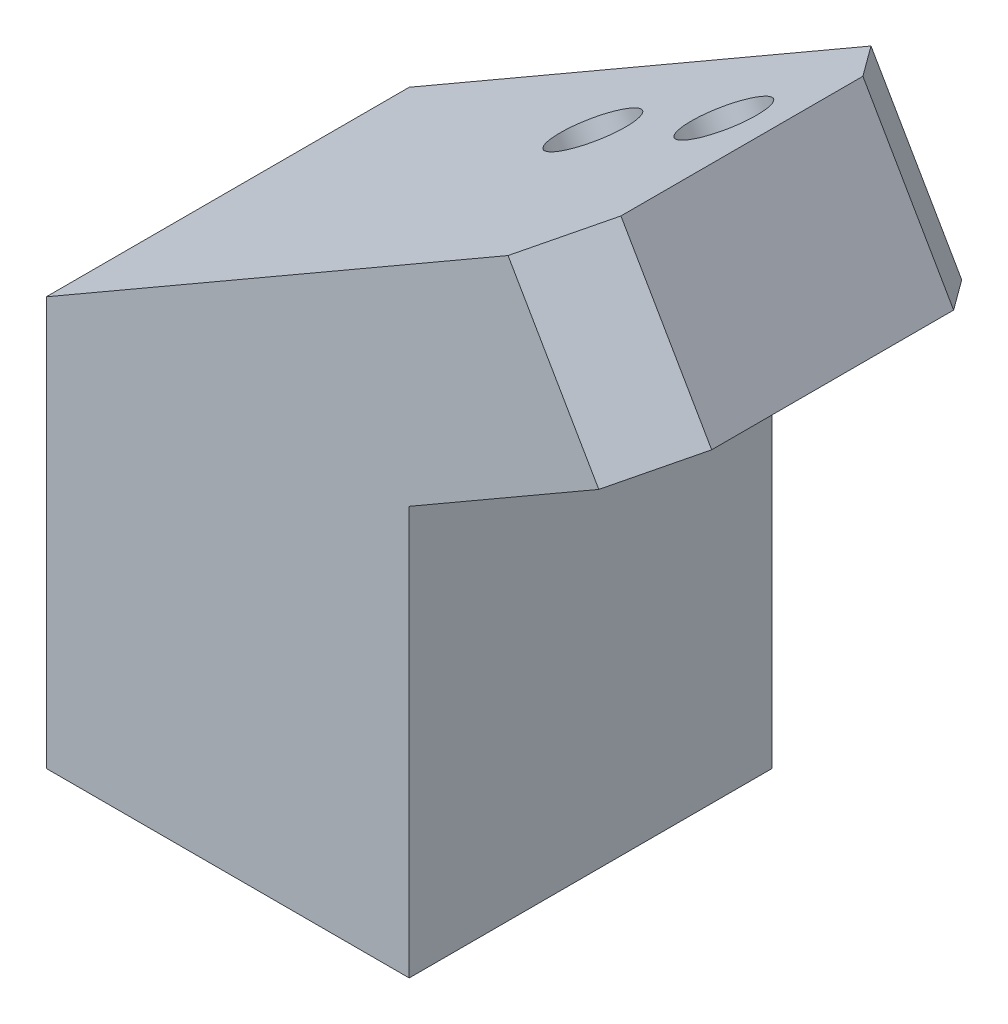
ISO-10303-21;
HEADER;
FILE_DESCRIPTION(('STEP AP214'),'2;1');
FILE_NAME('part.step','',(''),(''),'','','');
FILE_SCHEMA(('AUTOMOTIVE_DESIGN { 1 0 10303 214 1 1 1 1 }'));
ENDSEC;
DATA;
#1=APPLICATION_CONTEXT('core data for automotive mechanical design processes');
#2=APPLICATION_PROTOCOL_DEFINITION('international standard','automotive_design',2000,#1);
#3=PRODUCT_CONTEXT('',#1,'mechanical');
#4=PRODUCT('Part','Part','',(#3));
#5=PRODUCT_RELATED_PRODUCT_CATEGORY('part','',(#4));
#6=PRODUCT_DEFINITION_FORMATION('','',#4);
#7=PRODUCT_DEFINITION_CONTEXT('part definition',#1,'design');
#8=PRODUCT_DEFINITION('design','',#6,#7);
#9=PRODUCT_DEFINITION_SHAPE('','',#8);
#10=(LENGTH_UNIT() NAMED_UNIT(*) SI_UNIT(.MILLI.,.METRE.));
#11=(NAMED_UNIT(*) PLANE_ANGLE_UNIT() SI_UNIT($,.RADIAN.));
#12=(NAMED_UNIT(*) SI_UNIT($,.STERADIAN.) SOLID_ANGLE_UNIT());
#13=UNCERTAINTY_MEASURE_WITH_UNIT(LENGTH_MEASURE(1.E-05),#10,'distance_accuracy_value','');
#14=(GEOMETRIC_REPRESENTATION_CONTEXT(3) GLOBAL_UNCERTAINTY_ASSIGNED_CONTEXT((#13)) GLOBAL_UNIT_ASSIGNED_CONTEXT((#10,
#11,#12)) REPRESENTATION_CONTEXT('',''));
#15=CARTESIAN_POINT('',(0.,0.,0.));
#16=DIRECTION('',(0.,0.,1.));
#17=DIRECTION('',(1.,0.,0.));
#18=AXIS2_PLACEMENT_3D('',#15,#16,#17);
#19=CARTESIAN_POINT('',(45.9711431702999,-64.2630029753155,12.));
#20=DIRECTION('',(0.,1.,0.));
#21=DIRECTION('',(0.,0.,1.));
#22=AXIS2_PLACEMENT_3D('',#19,#20,#21);
#23=PLANE('',#22);
#24=CARTESIAN_POINT('',(59.9711431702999,-64.2630029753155,3.25));
#25=DIRECTION('',(0.,-1.,0.));
#26=DIRECTION('',(0.,0.,-1.));
#27=AXIS2_PLACEMENT_3D('',#24,#25,#26);
#28=CIRCLE('',#27,1.24999999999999);
#29=CARTESIAN_POINT('',(59.9711431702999,-64.2630029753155,2.00000000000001));
#30=VERTEX_POINT('',#29);
#31=EDGE_CURVE('E103',#30,#30,#28,.T.);
#32=ORIENTED_EDGE('',*,*,#31,.F.);
#33=EDGE_LOOP('',(#32));
#34=FACE_BOUND('',#33,.T.);
#35=CARTESIAN_POINT('',(55.9711431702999,-64.2630029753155,8.75));
#36=DIRECTION('',(0.,-1.,0.));
#37=DIRECTION('',(0.,0.,-1.));
#38=AXIS2_PLACEMENT_3D('',#35,#36,#37);
#39=CIRCLE('',#38,1.24999999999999);
#40=CARTESIAN_POINT('',(55.9711431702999,-64.2630029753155,7.50000000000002));
#41=VERTEX_POINT('',#40);
#42=EDGE_CURVE('E102',#41,#41,#39,.T.);
#43=ORIENTED_EDGE('',*,*,#42,.F.);
#44=EDGE_LOOP('',(#43));
#45=FACE_BOUND('',#44,.T.);
#46=DIRECTION('',(1.,0.,0.));
#47=VECTOR('',#46,1.);
#48=CARTESIAN_POINT('',(45.9711431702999,-64.2630029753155,12.));
#49=LINE('',#48,#47);
#50=CARTESIAN_POINT('',(51.9711431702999,-64.2630029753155,12.));
#51=VERTEX_POINT('',#50);
#52=CARTESIAN_POINT('',(63.9711431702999,-64.2630029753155,12.));
#53=VERTEX_POINT('',#52);
#54=EDGE_CURVE('E129',#51,#53,#49,.T.);
#55=ORIENTED_EDGE('',*,*,#54,.F.);
#56=DIRECTION('',(0.,0.,1.));
#57=VECTOR('',#56,1.);
#58=CARTESIAN_POINT('',(51.9711431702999,-64.2630029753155,0.));
#59=LINE('',#58,#57);
#60=CARTESIAN_POINT('',(51.9711431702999,-64.2630029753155,0.));
#61=VERTEX_POINT('',#60);
#62=EDGE_CURVE('E113',#61,#51,#59,.T.);
#63=ORIENTED_EDGE('',*,*,#62,.F.);
#64=DIRECTION('',(1.,0.,0.));
#65=VECTOR('',#64,1.);
#66=CARTESIAN_POINT('',(45.9711431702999,-64.2630029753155,0.));
#67=LINE('',#66,#65);
#68=CARTESIAN_POINT('',(63.9711431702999,-64.2630029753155,0.));
#69=VERTEX_POINT('',#68);
#70=EDGE_CURVE('E140',#61,#69,#67,.T.);
#71=ORIENTED_EDGE('',*,*,#70,.T.);
#72=DIRECTION('',(0.,0.,-1.));
#73=VECTOR('',#72,1.);
#74=CARTESIAN_POINT('',(63.9711431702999,-64.2630029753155,12.));
#75=LINE('',#74,#73);
#76=EDGE_CURVE('E159',#53,#69,#75,.T.);
#77=ORIENTED_EDGE('',*,*,#76,.F.);
#78=EDGE_LOOP('',(#55,#63,#71,#77));
#79=FACE_BOUND('',#78,.T.);
#80=ADVANCED_FACE('F16',(#34,#45,#79),#23,.F.);
#81=CARTESIAN_POINT('',(63.9711431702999,-64.2630029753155,12.));
#82=DIRECTION('',(-1.,0.,0.));
#83=DIRECTION('',(0.,0.,1.));
#84=AXIS2_PLACEMENT_3D('',#81,#82,#83);
#85=PLANE('',#84);
#86=DIRECTION('',(0.,1.,0.));
#87=VECTOR('',#86,1.);
#88=CARTESIAN_POINT('',(63.9711431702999,-64.2630029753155,0.));
#89=LINE('',#88,#87);
#90=CARTESIAN_POINT('',(63.9711431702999,-50.7574494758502,0.));
#91=VERTEX_POINT('',#90);
#92=EDGE_CURVE('E142',#69,#91,#89,.T.);
#93=ORIENTED_EDGE('',*,*,#92,.T.);
#94=DIRECTION('',(0.,0.,-1.));
#95=VECTOR('',#94,1.);
#96=CARTESIAN_POINT('',(63.9711431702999,-50.7574494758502,12.));
#97=LINE('',#96,#95);
#98=CARTESIAN_POINT('',(63.9711431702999,-50.7574494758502,3.82439937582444));
#99=VERTEX_POINT('',#98);
#100=EDGE_CURVE('E155',#99,#91,#97,.T.);
#101=ORIENTED_EDGE('',*,*,#100,.F.);
#102=CARTESIAN_POINT('',(63.9711431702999,-50.7574494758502,4.17560062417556));
#103=VERTEX_POINT('',#102);
#104=EDGE_CURVE('E160',#103,#99,#97,.T.);
#105=ORIENTED_EDGE('',*,*,#104,.F.);
#106=CARTESIAN_POINT('',(63.9711431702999,-50.7574494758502,12.));
#107=VERTEX_POINT('',#106);
#108=EDGE_CURVE('E156',#107,#103,#97,.T.);
#109=ORIENTED_EDGE('',*,*,#108,.F.);
#110=DIRECTION('',(0.,1.,0.));
#111=VECTOR('',#110,1.);
#112=CARTESIAN_POINT('',(63.9711431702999,-64.2630029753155,12.));
#113=LINE('',#112,#111);
#114=EDGE_CURVE('E131',#53,#107,#113,.T.);
#115=ORIENTED_EDGE('',*,*,#114,.F.);
#116=ORIENTED_EDGE('',*,*,#76,.T.);
#117=EDGE_LOOP('',(#93,#101,#105,#109,#115,#116));
#118=FACE_BOUND('',#117,.T.);
#119=ADVANCED_FACE('F213',(#118),#85,.F.);
#120=CARTESIAN_POINT('',(71.9711431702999,-46.1386473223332,12.));
#121=DIRECTION('',(-0.5,0.86602540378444,0.));
#122=DIRECTION('',(-0.86602540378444,-0.5,0.));
#123=AXIS2_PLACEMENT_3D('',#120,#121,#122);
#124=PLANE('',#123);
#125=CARTESIAN_POINT('',(69.3730669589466,-47.6386473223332,4.));
#126=DIRECTION('',(0.5,-0.86602540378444,0.));
#127=DIRECTION('',(0.86602540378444,0.5,0.));
#128=AXIS2_PLACEMENT_3D('',#125,#126,#127);
#129=CIRCLE('',#128,1.24999999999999);
#130=CARTESIAN_POINT('',(70.4555987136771,-47.0136473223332,4.));
#131=VERTEX_POINT('',#130);
#132=EDGE_CURVE('E119',#131,#131,#129,.T.);
#133=ORIENTED_EDGE('',*,*,#132,.F.);
#134=EDGE_LOOP('',(#133));
#135=FACE_BOUND('',#134,.T.);
#136=DIRECTION('',(0.86602540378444,0.5,0.));
#137=VECTOR('',#136,1.);
#138=CARTESIAN_POINT('',(71.9711431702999,-46.1386473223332,0.));
#139=LINE('',#138,#137);
#140=CARTESIAN_POINT('',(70.239092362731,-47.1386473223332,0.));
#141=VERTEX_POINT('',#140);
#142=EDGE_CURVE('E145',#91,#141,#139,.T.);
#143=ORIENTED_EDGE('',*,*,#142,.T.);
#144=DIRECTION('',(-0.612372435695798,-0.353553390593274,-0.707106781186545));
#145=VECTOR('',#144,1.);
#146=CARTESIAN_POINT('',(71.9711431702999,-46.1386473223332,2.));
#147=LINE('',#146,#145);
#148=CARTESIAN_POINT('',(71.9711431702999,-46.1386473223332,2.));
#149=VERTEX_POINT('',#148);
#150=EDGE_CURVE('E177',#141,#149,#147,.F.);
#151=ORIENTED_EDGE('',*,*,#150,.T.);
#152=DIRECTION('',(0.,0.,-1.));
#153=VECTOR('',#152,1.);
#154=CARTESIAN_POINT('',(71.9711431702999,-46.1386473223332,12.));
#155=LINE('',#154,#153);
#156=CARTESIAN_POINT('',(71.9711431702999,-46.1386473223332,10.));
#157=VERTEX_POINT('',#156);
#158=EDGE_CURVE('E152',#157,#149,#155,.T.);
#159=ORIENTED_EDGE('',*,*,#158,.F.);
#160=DIRECTION('',(-0.612372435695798,-0.353553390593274,0.707106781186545));
#161=VECTOR('',#160,1.);
#162=CARTESIAN_POINT('',(70.239092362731,-47.1386473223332,12.));
#163=LINE('',#162,#161);
#164=CARTESIAN_POINT('',(70.239092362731,-47.1386473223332,12.));
#165=VERTEX_POINT('',#164);
#166=EDGE_CURVE('E38',#157,#165,#163,.T.);
#167=ORIENTED_EDGE('',*,*,#166,.T.);
#168=DIRECTION('',(0.86602540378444,0.5,0.));
#169=VECTOR('',#168,1.);
#170=CARTESIAN_POINT('',(71.9711431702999,-46.1386473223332,12.));
#171=LINE('',#170,#169);
#172=EDGE_CURVE('E134',#107,#165,#171,.T.);
#173=ORIENTED_EDGE('',*,*,#172,.F.);
#174=ORIENTED_EDGE('',*,*,#108,.T.);
#175=CARTESIAN_POINT('',(65.0429399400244,-50.1386473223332,4.));
#176=DIRECTION('',(0.5,-0.86602540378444,0.));
#177=DIRECTION('',(0.86602540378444,0.5,0.));
#178=AXIS2_PLACEMENT_3D('',#175,#176,#177);
#179=CIRCLE('',#178,1.24999999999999);
#180=EDGE_CURVE('E125',#99,#103,#179,.T.);
#181=ORIENTED_EDGE('',*,*,#180,.F.);
#182=ORIENTED_EDGE('',*,*,#100,.T.);
#183=EDGE_LOOP('',(#143,#151,#159,#167,#173,#174,#181,#182));
#184=FACE_BOUND('',#183,.T.);
#185=ADVANCED_FACE('F197',(#135,#184),#124,.F.);
#186=CARTESIAN_POINT('',(68.9711431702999,-40.9424948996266,12.));
#187=DIRECTION('',(-0.86602540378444,-0.5,0.));
#188=DIRECTION('',(0.5,-0.86602540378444,0.));
#189=AXIS2_PLACEMENT_3D('',#186,#187,#188);
#190=PLANE('',#189);
#191=ORIENTED_EDGE('',*,*,#158,.T.);
#192=DIRECTION('',(-0.5,0.86602540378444,0.));
#193=VECTOR('',#192,1.);
#194=CARTESIAN_POINT('',(68.9711431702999,-40.9424948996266,2.));
#195=LINE('',#194,#193);
#196=CARTESIAN_POINT('',(68.9711431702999,-40.9424948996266,2.));
#197=VERTEX_POINT('',#196);
#198=EDGE_CURVE('E167',#149,#197,#195,.T.);
#199=ORIENTED_EDGE('',*,*,#198,.T.);
#200=DIRECTION('',(0.,0.,-1.));
#201=VECTOR('',#200,1.);
#202=CARTESIAN_POINT('',(68.9711431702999,-40.9424948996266,12.));
#203=LINE('',#202,#201);
#204=CARTESIAN_POINT('',(68.9711431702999,-40.9424948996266,10.));
#205=VERTEX_POINT('',#204);
#206=EDGE_CURVE('E139',#205,#197,#203,.T.);
#207=ORIENTED_EDGE('',*,*,#206,.F.);
#208=DIRECTION('',(0.5,-0.86602540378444,0.));
#209=VECTOR('',#208,1.);
#210=CARTESIAN_POINT('',(71.9711431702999,-46.1386473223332,10.));
#211=LINE('',#210,#209);
#212=EDGE_CURVE('E163',#205,#157,#211,.T.);
#213=ORIENTED_EDGE('',*,*,#212,.T.);
#214=EDGE_LOOP('',(#191,#199,#207,#213));
#215=FACE_BOUND('',#214,.T.);
#216=ADVANCED_FACE('F199',(#215),#190,.F.);
#217=CARTESIAN_POINT('',(68.9711431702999,-40.9424948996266,12.));
#218=DIRECTION('',(0.5,-0.866025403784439,0.));
#219=DIRECTION('',(0.866025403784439,0.5,0.));
#220=AXIS2_PLACEMENT_3D('',#217,#218,#219);
#221=PLANE('',#220);
#222=CARTESIAN_POINT('',(66.3730669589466,-42.4424948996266,4.));
#223=DIRECTION('',(0.5,-0.866025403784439,0.));
#224=DIRECTION('',(0.866025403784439,0.5,0.));
#225=AXIS2_PLACEMENT_3D('',#222,#223,#224);
#226=CIRCLE('',#225,1.25);
#227=CARTESIAN_POINT('',(67.4555987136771,-41.8174948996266,4.));
#228=VERTEX_POINT('',#227);
#229=EDGE_CURVE('E122',#228,#228,#226,.T.);
#230=ORIENTED_EDGE('',*,*,#229,.T.);
#231=EDGE_LOOP('',(#230));
#232=FACE_BOUND('',#231,.T.);
#233=CARTESIAN_POINT('',(62.0429399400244,-44.9424948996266,4.));
#234=DIRECTION('',(0.5,-0.866025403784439,0.));
#235=DIRECTION('',(0.866025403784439,0.5,0.));
#236=AXIS2_PLACEMENT_3D('',#233,#234,#235);
#237=CIRCLE('',#236,1.25);
#238=CARTESIAN_POINT('',(63.1254716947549,-44.3174948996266,4.));
#239=VERTEX_POINT('',#238);
#240=EDGE_CURVE('E128',#239,#239,#237,.T.);
#241=ORIENTED_EDGE('',*,*,#240,.T.);
#242=EDGE_LOOP('',(#241));
#243=FACE_BOUND('',#242,.T.);
#244=DIRECTION('',(-0.866025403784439,-0.5,0.));
#245=VECTOR('',#244,1.);
#246=CARTESIAN_POINT('',(68.9711431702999,-40.9424948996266,0.));
#247=LINE('',#246,#245);
#248=CARTESIAN_POINT('',(67.239092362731,-41.9424948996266,0.));
#249=VERTEX_POINT('',#248);
#250=CARTESIAN_POINT('',(51.9711431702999,-50.7574494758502,0.));
#251=VERTEX_POINT('',#250);
#252=EDGE_CURVE('E132',#249,#251,#247,.T.);
#253=ORIENTED_EDGE('',*,*,#252,.T.);
#254=DIRECTION('',(0.,0.,1.));
#255=VECTOR('',#254,1.);
#256=CARTESIAN_POINT('',(51.9711431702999,-50.7574494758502,12.));
#257=LINE('',#256,#255);
#258=CARTESIAN_POINT('',(51.9711431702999,-50.7574494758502,12.));
#259=VERTEX_POINT('',#258);
#260=EDGE_CURVE('E31',#251,#259,#257,.T.);
#261=ORIENTED_EDGE('',*,*,#260,.T.);
#262=DIRECTION('',(-0.866025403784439,-0.5,0.));
#263=VECTOR('',#262,1.);
#264=CARTESIAN_POINT('',(68.9711431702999,-40.9424948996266,12.));
#265=LINE('',#264,#263);
#266=CARTESIAN_POINT('',(67.239092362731,-41.9424948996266,12.));
#267=VERTEX_POINT('',#266);
#268=EDGE_CURVE('E136',#267,#259,#265,.T.);
#269=ORIENTED_EDGE('',*,*,#268,.F.);
#270=DIRECTION('',(0.612372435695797,0.353553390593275,-0.707106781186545));
#271=VECTOR('',#270,1.);
#272=CARTESIAN_POINT('',(67.2390923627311,-41.9424948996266,12.));
#273=LINE('',#272,#271);
#274=EDGE_CURVE('E170',#267,#205,#273,.T.);
#275=ORIENTED_EDGE('',*,*,#274,.T.);
#276=ORIENTED_EDGE('',*,*,#206,.T.);
#277=DIRECTION('',(0.612372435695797,0.353553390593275,0.707106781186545));
#278=VECTOR('',#277,1.);
#279=CARTESIAN_POINT('',(68.9711431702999,-40.9424948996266,2.));
#280=LINE('',#279,#278);
#281=EDGE_CURVE('E172',#197,#249,#280,.F.);
#282=ORIENTED_EDGE('',*,*,#281,.T.);
#283=EDGE_LOOP('',(#253,#261,#269,#275,#276,#282));
#284=FACE_BOUND('',#283,.T.);
#285=ADVANCED_FACE('F185',(#232,#243,#284),#221,.F.);
#286=CARTESIAN_POINT('',(0.,0.,12.));
#287=DIRECTION('',(0.,0.,1.));
#288=DIRECTION('',(1.,0.,0.));
#289=AXIS2_PLACEMENT_3D('',#286,#287,#288);
#290=PLANE('',#289);
#291=DIRECTION('',(0.,-1.,0.));
#292=VECTOR('',#291,1.);
#293=CARTESIAN_POINT('',(51.9711431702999,-40.9424948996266,12.));
#294=LINE('',#293,#292);
#295=EDGE_CURVE('E115',#259,#51,#294,.T.);
#296=ORIENTED_EDGE('',*,*,#295,.T.);
#297=ORIENTED_EDGE('',*,*,#54,.T.);
#298=ORIENTED_EDGE('',*,*,#114,.T.);
#299=ORIENTED_EDGE('',*,*,#172,.T.);
#300=DIRECTION('',(-0.5,0.86602540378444,0.));
#301=VECTOR('',#300,1.);
#302=CARTESIAN_POINT('',(67.239092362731,-41.9424948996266,12.));
#303=LINE('',#302,#301);
#304=EDGE_CURVE('E24',#165,#267,#303,.T.);
#305=ORIENTED_EDGE('',*,*,#304,.T.);
#306=ORIENTED_EDGE('',*,*,#268,.T.);
#307=EDGE_LOOP('',(#296,#297,#298,#299,#305,#306));
#308=FACE_BOUND('',#307,.T.);
#309=ADVANCED_FACE('F182',(#308),#290,.T.);
#310=CARTESIAN_POINT('',(0.,0.,0.));
#311=DIRECTION('',(0.,0.,1.));
#312=DIRECTION('',(1.,0.,0.));
#313=AXIS2_PLACEMENT_3D('',#310,#311,#312);
#314=PLANE('',#313);
#315=ORIENTED_EDGE('',*,*,#70,.F.);
#316=DIRECTION('',(0.,1.,0.));
#317=VECTOR('',#316,1.);
#318=CARTESIAN_POINT('',(51.9711431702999,0.,0.));
#319=LINE('',#318,#317);
#320=EDGE_CURVE('E11',#61,#251,#319,.T.);
#321=ORIENTED_EDGE('',*,*,#320,.T.);
#322=ORIENTED_EDGE('',*,*,#252,.F.);
#323=DIRECTION('',(0.5,-0.86602540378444,0.));
#324=VECTOR('',#323,1.);
#325=CARTESIAN_POINT('',(32.2676862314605,18.62975733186,0.));
#326=LINE('',#325,#324);
#327=EDGE_CURVE('E174',#249,#141,#326,.T.);
#328=ORIENTED_EDGE('',*,*,#327,.T.);
#329=ORIENTED_EDGE('',*,*,#142,.F.);
#330=ORIENTED_EDGE('',*,*,#92,.F.);
#331=EDGE_LOOP('',(#315,#321,#322,#328,#329,#330));
#332=FACE_BOUND('',#331,.T.);
#333=ADVANCED_FACE('F191',(#332),#314,.F.);
#334=CARTESIAN_POINT('',(65.0429399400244,-50.1386473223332,4.));
#335=DIRECTION('',(0.5,-0.86602540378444,0.));
#336=DIRECTION('',(0.86602540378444,0.5,0.));
#337=AXIS2_PLACEMENT_3D('',#334,#335,#336);
#338=CYLINDRICAL_SURFACE('',#337,1.25);
#339=EDGE_CURVE('E126',#103,#99,#179,.T.);
#340=ORIENTED_EDGE('',*,*,#339,.T.);
#341=ORIENTED_EDGE('',*,*,#180,.T.);
#342=EDGE_LOOP('',(#340,#341));
#343=FACE_BOUND('',#342,.T.);
#344=ORIENTED_EDGE('',*,*,#240,.F.);
#345=EDGE_LOOP('',(#344));
#346=FACE_BOUND('',#345,.T.);
#347=ADVANCED_FACE('F235',(#343,#346),#338,.F.);
#348=CARTESIAN_POINT('',(65.0429399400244,-50.1386473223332,5.25));
#349=DIRECTION('',(0.5,-0.86602540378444,0.));
#350=DIRECTION('',(0.86602540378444,0.5,0.));
#351=AXIS2_PLACEMENT_3D('',#348,#349,#350);
#352=PLANE('',#351);
#353=ORIENTED_EDGE('',*,*,#104,.T.);
#354=ORIENTED_EDGE('',*,*,#339,.F.);
#355=EDGE_LOOP('',(#353,#354));
#356=FACE_BOUND('',#355,.T.);
#357=ADVANCED_FACE('F238',(#356),#352,.F.);
#358=CARTESIAN_POINT('',(69.3730669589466,-47.6386473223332,4.));
#359=DIRECTION('',(0.5,-0.86602540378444,0.));
#360=DIRECTION('',(0.86602540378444,0.5,0.));
#361=AXIS2_PLACEMENT_3D('',#358,#359,#360);
#362=CYLINDRICAL_SURFACE('',#361,1.25);
#363=ORIENTED_EDGE('',*,*,#132,.T.);
#364=EDGE_LOOP('',(#363));
#365=FACE_BOUND('',#364,.T.);
#366=ORIENTED_EDGE('',*,*,#229,.F.);
#367=EDGE_LOOP('',(#366));
#368=FACE_BOUND('',#367,.T.);
#369=ADVANCED_FACE('F211',(#365,#368),#362,.F.);
#370=CARTESIAN_POINT('',(68.9711431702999,-40.9424948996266,2.));
#371=DIRECTION('',(-0.612372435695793,-0.353553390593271,0.70710678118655));
#372=DIRECTION('',(-0.5,0.86602540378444,0.));
#373=AXIS2_PLACEMENT_3D('',#370,#371,#372);
#374=PLANE('',#373);
#375=ORIENTED_EDGE('',*,*,#150,.F.);
#376=ORIENTED_EDGE('',*,*,#327,.F.);
#377=ORIENTED_EDGE('',*,*,#281,.F.);
#378=ORIENTED_EDGE('',*,*,#198,.F.);
#379=EDGE_LOOP('',(#375,#376,#377,#378));
#380=FACE_BOUND('',#379,.T.);
#381=ADVANCED_FACE('F195',(#380),#374,.F.);
#382=CARTESIAN_POINT('',(32.2676862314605,18.62975733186,12.));
#383=DIRECTION('',(0.612372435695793,0.353553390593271,0.70710678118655));
#384=DIRECTION('',(0.5,-0.86602540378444,0.));
#385=AXIS2_PLACEMENT_3D('',#382,#383,#384);
#386=PLANE('',#385);
#387=ORIENTED_EDGE('',*,*,#166,.F.);
#388=ORIENTED_EDGE('',*,*,#212,.F.);
#389=ORIENTED_EDGE('',*,*,#274,.F.);
#390=ORIENTED_EDGE('',*,*,#304,.F.);
#391=EDGE_LOOP('',(#387,#388,#389,#390));
#392=FACE_BOUND('',#391,.T.);
#393=ADVANCED_FACE('F18',(#392),#386,.T.);
#394=CARTESIAN_POINT('',(51.9711431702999,-40.9424948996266,0.));
#395=DIRECTION('',(1.,0.,0.));
#396=DIRECTION('',(0.,0.,-1.));
#397=AXIS2_PLACEMENT_3D('',#394,#395,#396);
#398=PLANE('',#397);
#399=ORIENTED_EDGE('',*,*,#320,.F.);
#400=ORIENTED_EDGE('',*,*,#62,.T.);
#401=ORIENTED_EDGE('',*,*,#295,.F.);
#402=ORIENTED_EDGE('',*,*,#260,.F.);
#403=EDGE_LOOP('',(#399,#400,#401,#402));
#404=FACE_BOUND('',#403,.T.);
#405=ADVANCED_FACE('F202',(#404),#398,.F.);
#406=CARTESIAN_POINT('',(55.9711431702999,-53.7630029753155,8.75));
#407=DIRECTION('',(0.,-1.,0.));
#408=DIRECTION('',(0.,0.,-1.));
#409=AXIS2_PLACEMENT_3D('',#406,#407,#408);
#410=CONICAL_SURFACE('',#409,1.25,1.02974425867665);
#411=CARTESIAN_POINT('',(55.9711431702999,-53.011927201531,8.75));
#412=VERTEX_POINT('',#411);
#413=VERTEX_LOOP('',#412);
#414=FACE_BOUND('',#413,.T.);
#415=CARTESIAN_POINT('',(55.9711431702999,-53.7630029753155,8.75));
#416=DIRECTION('',(0.,-1.,0.));
#417=DIRECTION('',(0.,0.,-1.));
#418=AXIS2_PLACEMENT_3D('',#415,#416,#417);
#419=CIRCLE('',#418,1.25);
#420=CARTESIAN_POINT('',(55.9711431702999,-53.7630029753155,7.5));
#421=VERTEX_POINT('',#420);
#422=EDGE_CURVE('E106',#421,#421,#419,.T.);
#423=ORIENTED_EDGE('',*,*,#422,.T.);
#424=EDGE_LOOP('',(#423));
#425=FACE_BOUND('',#424,.T.);
#426=ADVANCED_FACE('F209',(#414,#425),#410,.F.);
#427=CARTESIAN_POINT('',(55.9711431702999,-64.2630029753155,8.75));
#428=DIRECTION('',(0.,-1.,0.));
#429=DIRECTION('',(0.,0.,-1.));
#430=AXIS2_PLACEMENT_3D('',#427,#428,#429);
#431=CYLINDRICAL_SURFACE('',#430,1.25);
#432=ORIENTED_EDGE('',*,*,#422,.F.);
#433=EDGE_LOOP('',(#432));
#434=FACE_BOUND('',#433,.T.);
#435=ORIENTED_EDGE('',*,*,#42,.T.);
#436=EDGE_LOOP('',(#435));
#437=FACE_BOUND('',#436,.T.);
#438=ADVANCED_FACE('F96',(#434,#437),#431,.F.);
#439=CARTESIAN_POINT('',(59.9711431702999,-53.7630029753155,3.25));
#440=DIRECTION('',(0.,-1.,0.));
#441=DIRECTION('',(0.,0.,-1.));
#442=AXIS2_PLACEMENT_3D('',#439,#440,#441);
#443=CONICAL_SURFACE('',#442,1.25,1.02974425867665);
#444=CARTESIAN_POINT('',(59.9711431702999,-53.011927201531,3.25));
#445=VERTEX_POINT('',#444);
#446=VERTEX_LOOP('',#445);
#447=FACE_BOUND('',#446,.T.);
#448=CARTESIAN_POINT('',(59.9711431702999,-53.7630029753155,3.25));
#449=DIRECTION('',(0.,-1.,0.));
#450=DIRECTION('',(0.,0.,-1.));
#451=AXIS2_PLACEMENT_3D('',#448,#449,#450);
#452=CIRCLE('',#451,1.25);
#453=CARTESIAN_POINT('',(59.9711431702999,-53.7630029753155,2.));
#454=VERTEX_POINT('',#453);
#455=EDGE_CURVE('E100',#454,#454,#452,.T.);
#456=ORIENTED_EDGE('',*,*,#455,.T.);
#457=EDGE_LOOP('',(#456));
#458=FACE_BOUND('',#457,.T.);
#459=ADVANCED_FACE('F92',(#447,#458),#443,.F.);
#460=CARTESIAN_POINT('',(59.9711431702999,-64.2630029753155,3.25));
#461=DIRECTION('',(0.,-1.,0.));
#462=DIRECTION('',(0.,0.,-1.));
#463=AXIS2_PLACEMENT_3D('',#460,#461,#462);
#464=CYLINDRICAL_SURFACE('',#463,1.25);
#465=ORIENTED_EDGE('',*,*,#455,.F.);
#466=EDGE_LOOP('',(#465));
#467=FACE_BOUND('',#466,.T.);
#468=ORIENTED_EDGE('',*,*,#31,.T.);
#469=EDGE_LOOP('',(#468));
#470=FACE_BOUND('',#469,.T.);
#471=ADVANCED_FACE('F95',(#467,#470),#464,.F.);
#472=CLOSED_SHELL('',(#80,#119,#185,#216,#285,#309,#333,#347,#357,#369,#381,#393,#405,#426,#438,
#459,#471));
#473=MANIFOLD_SOLID_BREP('B1',#472);
#474=ADVANCED_BREP_SHAPE_REPRESENTATION('',(#18,#473),#14);
#475=SHAPE_DEFINITION_REPRESENTATION(#9,#474);
ENDSEC;
END-ISO-10303-21;
